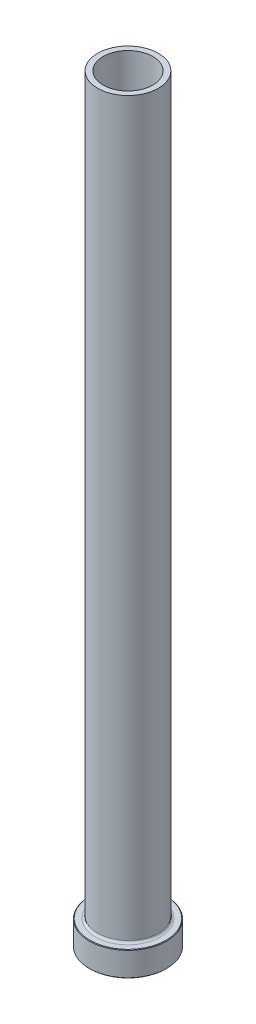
from build123d import *

# Parameters (mm, degrees)
FILLET1_R     = 0.8
CHAMFER1_SIZE = 0.2
CHAMFER3_SIZE = 0.5


with BuildPart() as part:
    # Sketch1 → Revolve1 (revolve)
    with BuildSketch(Plane.XY, mode=Mode.PRIVATE) as revolve1_sk:
        Polygon((-9, 275), (-11, 275), (-11, 9), (-14, 9), (-14, 0), (-9.25, 0), (-9.25, 208), (-9, 220), align=None)
    revolve(revolve1_sk.sketch.rotate(Axis((0, 92.187680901, 0), (0, -1, 0)), 270), axis=Axis((0, 92.187680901, 0), (0, -1, 0)))

    # Fillet1
    fillet1_edges = [part.edges().sort_by_distance(p)[0] for p in [
        (0, 9, -11),
    ]]
    fillet(fillet1_edges, radius=FILLET1_R)

    # Chamfer1
    chamfer1_edges = [part.edges().sort_by_distance(p)[0] for p in [
        (0, 0, -14),
        (0, 9, -14),
    ]]
    chamfer(chamfer1_edges, length=CHAMFER1_SIZE)

    # Chamfer3
    chamfer3_edges = [part.edges().sort_by_distance(p)[0] for p in [
        (0, 0, -9.25),
    ]]
    chamfer(chamfer3_edges, length=CHAMFER3_SIZE)


solid = part.part
